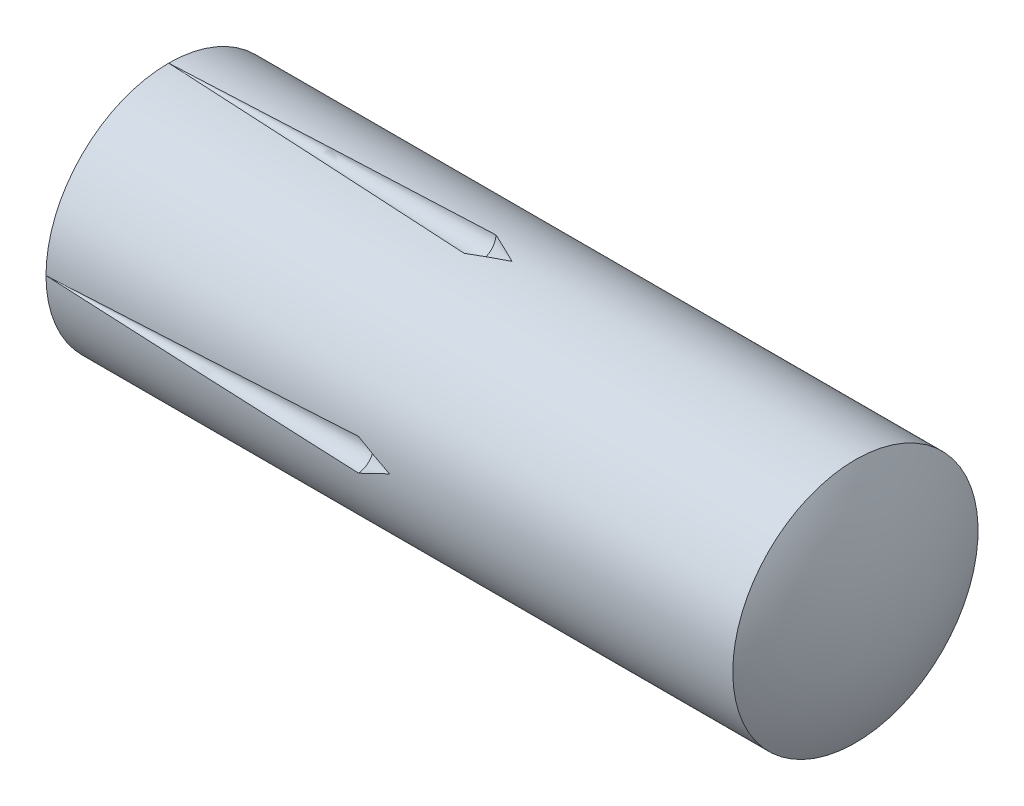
ISO-10303-21;
HEADER;
FILE_DESCRIPTION(('STEP AP214'),'2;1');
FILE_NAME('part.step','',(''),(''),'','','');
FILE_SCHEMA(('AUTOMOTIVE_DESIGN { 1 0 10303 214 1 1 1 1 }'));
ENDSEC;
DATA;
#1=APPLICATION_CONTEXT('core data for automotive mechanical design processes');
#2=APPLICATION_PROTOCOL_DEFINITION('international standard','automotive_design',2000,#1);
#3=PRODUCT_CONTEXT('',#1,'mechanical');
#4=PRODUCT('Part','Part','',(#3));
#5=PRODUCT_RELATED_PRODUCT_CATEGORY('part','',(#4));
#6=PRODUCT_DEFINITION_FORMATION('','',#4);
#7=PRODUCT_DEFINITION_CONTEXT('part definition',#1,'design');
#8=PRODUCT_DEFINITION('design','',#6,#7);
#9=PRODUCT_DEFINITION_SHAPE('','',#8);
#10=(LENGTH_UNIT() NAMED_UNIT(*) SI_UNIT(.MILLI.,.METRE.));
#11=(NAMED_UNIT(*) PLANE_ANGLE_UNIT() SI_UNIT($,.RADIAN.));
#12=(NAMED_UNIT(*) SI_UNIT($,.STERADIAN.) SOLID_ANGLE_UNIT());
#13=UNCERTAINTY_MEASURE_WITH_UNIT(LENGTH_MEASURE(1.E-05),#10,'distance_accuracy_value','');
#14=(GEOMETRIC_REPRESENTATION_CONTEXT(3) GLOBAL_UNCERTAINTY_ASSIGNED_CONTEXT((#13)) GLOBAL_UNIT_ASSIGNED_CONTEXT((#10,
#11,#12)) REPRESENTATION_CONTEXT('',''));
#15=CARTESIAN_POINT('',(0.,0.,0.));
#16=DIRECTION('',(0.,0.,1.));
#17=DIRECTION('',(1.,0.,0.));
#18=AXIS2_PLACEMENT_3D('',#15,#16,#17);
#19=CARTESIAN_POINT('',(0.,0.,0.));
#20=DIRECTION('',(-1.,0.,0.));
#21=DIRECTION('',(0.,0.,1.));
#22=AXIS2_PLACEMENT_3D('',#19,#20,#21);
#23=CYLINDRICAL_SURFACE('',#22,5.);
#24=CARTESIAN_POINT('',(29.3,0.,0.));
#25=DIRECTION('',(-1.,0.,0.));
#26=DIRECTION('',(0.,0.,1.));
#27=AXIS2_PLACEMENT_3D('',#24,#25,#26);
#28=CIRCLE('',#27,5.);
#29=CARTESIAN_POINT('',(29.3,0.,5.));
#30=VERTEX_POINT('',#29);
#31=EDGE_CURVE('E538',#30,#30,#28,.T.);
#32=ORIENTED_EDGE('',*,*,#31,.T.);
#33=EDGE_LOOP('',(#32));
#34=FACE_BOUND('',#33,.T.);
#35=CARTESIAN_POINT('',(1.3,0.,0.));
#36=DIRECTION('',(-1.,0.,0.));
#37=DIRECTION('',(0.,0.,1.));
#38=AXIS2_PLACEMENT_3D('',#35,#36,#37);
#39=CIRCLE('',#38,5.);
#40=CARTESIAN_POINT('',(1.3,0.,5.));
#41=VERTEX_POINT('',#40);
#42=CARTESIAN_POINT('',(1.3,5.,0.));
#43=VERTEX_POINT('',#42);
#44=EDGE_CURVE('E531',#41,#43,#39,.T.);
#45=ORIENTED_EDGE('',*,*,#44,.F.);
#46=CARTESIAN_POINT('',(1.3,0.,5.));
#47=CARTESIAN_POINT('',(1.30006543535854,3.34905383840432E-06,5.00000000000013));
#48=CARTESIAN_POINT('',(1.30013087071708,6.69810762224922E-06,4.99999999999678));
#49=CARTESIAN_POINT('',(1.30026094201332,1.33552999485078E-05,4.99999999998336));
#50=CARTESIAN_POINT('',(1.30032557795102,1.66634384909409E-05,4.99999999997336));
#51=CARTESIAN_POINT('',(1.30052028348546,2.66286823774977E-05,4.99999999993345));
#52=CARTESIAN_POINT('',(1.3006503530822,3.32857877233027E-05,4.99999999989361));
#53=CARTESIAN_POINT('',(1.30104056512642,5.32572703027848E-05,4.99999999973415));
#54=CARTESIAN_POINT('',(1.30130070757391,6.65716475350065E-05,4.99999999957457));
#55=CARTESIAN_POINT('',(1.30208114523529,0.00010651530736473,4.99999999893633));
#56=CARTESIAN_POINT('',(1.30260144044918,0.000133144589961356,4.99999999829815));
#57=CARTESIAN_POINT('',(1.30416236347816,0.000213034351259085,4.99999999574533));
#58=CARTESIAN_POINT('',(1.30520299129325,0.000266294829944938,4.99999999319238));
#59=CARTESIAN_POINT('',(1.30832502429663,0.000426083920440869,4.99999998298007));
#60=CARTESIAN_POINT('',(1.31040642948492,0.000532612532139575,4.99999997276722));
#61=CARTESIAN_POINT('',(1.31665124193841,0.000852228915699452,4.99999993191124));
#62=CARTESIAN_POINT('',(1.32081464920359,0.00106531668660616,4.99999989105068));
#63=CARTESIAN_POINT('',(1.33330725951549,0.00170470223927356,4.99999972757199));
#64=CARTESIAN_POINT('',(1.34163646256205,0.00213100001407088,4.99999956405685));
#65=CARTESIAN_POINT('',(1.36663363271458,0.00341038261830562,4.99999890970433));
#66=CARTESIAN_POINT('',(1.38330159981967,0.00426346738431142,4.99999825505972));
#67=CARTESIAN_POINT('',(1.43334380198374,0.00682468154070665,4.9999956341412));
#68=CARTESIAN_POINT('',(1.46671803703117,0.00853281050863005,4.99999301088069));
#69=CARTESIAN_POINT('',(1.56699440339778,0.0136650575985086,4.99998249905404));
#70=CARTESIAN_POINT('',(1.63389653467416,0.0170891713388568,4.99997196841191));
#71=CARTESIAN_POINT('',(1.83522124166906,0.027393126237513,4.99992969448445));
#72=CARTESIAN_POINT('',(1.96964381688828,0.034272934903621,4.99988726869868));
#73=CARTESIAN_POINT('',(2.37541462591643,0.0550402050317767,4.99971633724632));
#74=CARTESIAN_POINT('',(2.64676285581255,0.0689273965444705,4.99954416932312));
#75=CARTESIAN_POINT('',(3.47106496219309,0.111111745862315,4.9988453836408));
#76=CARTESIAN_POINT('',(4.02401880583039,0.139406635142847,4.99813634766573));
#77=CARTESIAN_POINT('',(5.72598095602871,0.226478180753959,4.99521440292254));
#78=CARTESIAN_POINT('',(6.87498897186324,0.28523477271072,4.99220427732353));
#79=CARTESIAN_POINT('',(10.5129699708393,0.471099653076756,4.97938873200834));
#80=CARTESIAN_POINT('',(13.0019401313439,0.598009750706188,4.96575247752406));
#81=CARTESIAN_POINT('',(15.4909027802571,0.724387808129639,4.94724795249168));
#82=B_SPLINE_CURVE_WITH_KNOTS('',3,(#46,#47,#48,#49,#50,#51,#52,#53,#54,#55,#56,#57,#58,#59,#60,
#61,#62,#63,#64,#65,#66,#67,#68,#69,#70,#71,#72,#73,#74,#75,#76,#77,#78,#79,#80,#81),
.UNSPECIFIED.,.F.,.F.,(4,2,2,2,2,2,2,2,2,2,2,2,2,2,2,2,2,4),(0.,0.000196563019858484,
0.000390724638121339,0.000781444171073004,0.00156289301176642,0.00312582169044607,
0.00625179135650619,0.0125041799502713,0.025010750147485,0.0500310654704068,0.100100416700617,
0.200354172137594,0.401323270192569,0.805118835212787,1.6202290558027,3.28126212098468,
6.73280018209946,14.209504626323),.UNSPECIFIED.);
#83=CARTESIAN_POINT('',(14.,0.648625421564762,4.95774999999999));
#84=VERTEX_POINT('',#83);
#85=EDGE_CURVE('E11',#41,#84,#82,.T.);
#86=ORIENTED_EDGE('',*,*,#85,.T.);
#87=CARTESIAN_POINT('',(15.3,0.,5.));
#88=CARTESIAN_POINT('',(15.2999927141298,3.642935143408E-06,5.00000000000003));
#89=CARTESIAN_POINT('',(15.2999854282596,7.28587023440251E-06,4.99999999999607));
#90=CARTESIAN_POINT('',(15.2999185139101,4.0743045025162E-05,4.99999999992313));
#91=CARTESIAN_POINT('',(15.2998588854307,7.05572847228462E-05,4.99999999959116));
#92=CARTESIAN_POINT('',(15.2995607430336,0.00021962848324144,4.99999999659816));
#93=CARTESIAN_POINT('',(15.2993222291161,0.000338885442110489,4.99999998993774));
#94=CARTESIAN_POINT('',(15.298129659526,0.000935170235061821,4.99999993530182));
#95=CARTESIAN_POINT('',(15.297175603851,0.00141219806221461,4.99999982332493));
#96=CARTESIAN_POINT('',(15.2924053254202,0.00379733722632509,4.99999892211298));
#97=CARTESIAN_POINT('',(15.288589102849,0.00570544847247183,4.99999710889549));
#98=CARTESIAN_POINT('',(15.269507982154,0.0152460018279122,4.99998258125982));
#99=CARTESIAN_POINT('',(15.2542430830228,0.0228784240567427,4.9999534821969));
#100=CARTESIAN_POINT('',(15.1779181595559,0.0610403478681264,4.99972061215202));
#101=CARTESIAN_POINT('',(15.1168582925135,0.0915685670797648,4.99925471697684));
#102=CARTESIAN_POINT('',(14.811529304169,0.244198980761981,4.99552646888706));
#103=CARTESIAN_POINT('',(14.5672635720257,0.366222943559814,4.98806779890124));
#104=CARTESIAN_POINT('',(13.7412905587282,0.77772857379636,4.94772324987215));
#105=CARTESIAN_POINT('',(13.159729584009,1.06559963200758,4.8939430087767));
#106=CARTESIAN_POINT('',(12.5787204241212,1.34798590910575,4.8148659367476));
#107=B_SPLINE_CURVE_WITH_KNOTS('',3,(#87,#88,#89,#90,#91,#92,#93,#94,#95,#96,#97,#98,#99,#100,
#101,#102,#103,#104,#105,#106),.UNSPECIFIED.,.F.,.F.,(4,2,2,2,2,2,2,2,2,4),(0.,
2.44375515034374E-05,0.000224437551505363,0.00102443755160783,0.00422443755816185,
0.0170244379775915,0.0682244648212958,0.273026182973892,1.09233630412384,3.043839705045),.UNSPECIFIED.);
#108=CARTESIAN_POINT('',(15.3,0.,5.));
#109=VERTEX_POINT('',#108);
#110=EDGE_CURVE('E633',#84,#109,#107,.F.);
#111=ORIENTED_EDGE('',*,*,#110,.T.);
#112=CARTESIAN_POINT('',(15.3,0.,5.));
#113=CARTESIAN_POINT('',(15.2999927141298,-3.6429350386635E-06,5.00000000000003));
#114=CARTESIAN_POINT('',(15.2999854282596,-7.28587012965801E-06,4.99999999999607));
#115=CARTESIAN_POINT('',(15.2999185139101,-4.07430449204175E-05,4.99999999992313));
#116=CARTESIAN_POINT('',(15.2998588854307,-7.05572846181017E-05,4.99999999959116));
#117=CARTESIAN_POINT('',(15.2995607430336,-0.000219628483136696,4.99999999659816));
#118=CARTESIAN_POINT('',(15.2993222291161,-0.000338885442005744,4.99999998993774));
#119=CARTESIAN_POINT('',(15.298129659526,-0.000935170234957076,4.99999993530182));
#120=CARTESIAN_POINT('',(15.297175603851,-0.00141219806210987,4.99999982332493));
#121=CARTESIAN_POINT('',(15.2924053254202,-0.00379733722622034,4.99999892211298));
#122=CARTESIAN_POINT('',(15.288589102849,-0.00570544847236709,4.99999710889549));
#123=CARTESIAN_POINT('',(15.269507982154,-0.0152460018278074,4.99998258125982));
#124=CARTESIAN_POINT('',(15.2542430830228,-0.0228784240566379,4.9999534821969));
#125=CARTESIAN_POINT('',(15.1779181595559,-0.0610403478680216,4.99972061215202));
#126=CARTESIAN_POINT('',(15.1168582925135,-0.09156856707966,4.99925471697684));
#127=CARTESIAN_POINT('',(14.811529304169,-0.244198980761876,4.99552646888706));
#128=CARTESIAN_POINT('',(14.5672635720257,-0.366222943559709,4.98806779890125));
#129=CARTESIAN_POINT('',(13.7412905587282,-0.777728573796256,4.94772324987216));
#130=CARTESIAN_POINT('',(13.159729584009,-1.06559963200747,4.89394300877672));
#131=CARTESIAN_POINT('',(12.5787204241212,-1.34798590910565,4.81486593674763));
#132=B_SPLINE_CURVE_WITH_KNOTS('',3,(#112,#113,#114,#115,#116,#117,#118,#119,#120,#121,#122,
#123,#124,#125,#126,#127,#128,#129,#130,#131),.UNSPECIFIED.,.F.,.F.,(4,2,2,2,2,2,2,2,2,4),(0.,
2.44375515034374E-05,0.000224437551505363,0.00102443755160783,0.00422443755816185,
0.0170244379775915,0.0682244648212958,0.273026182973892,1.09233630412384,3.043839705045),.UNSPECIFIED.);
#133=CARTESIAN_POINT('',(14.,-0.648625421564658,4.95775000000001));
#134=VERTEX_POINT('',#133);
#135=EDGE_CURVE('E469',#109,#134,#132,.T.);
#136=ORIENTED_EDGE('',*,*,#135,.T.);
#137=CARTESIAN_POINT('',(1.3,0.,5.));
#138=CARTESIAN_POINT('',(1.30006543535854,-3.34905373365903E-06,5.00000000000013));
#139=CARTESIAN_POINT('',(1.30013087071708,-6.69810751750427E-06,4.99999999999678));
#140=CARTESIAN_POINT('',(1.3002609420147,-1.33552999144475E-05,4.99999999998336));
#141=CARTESIAN_POINT('',(1.30032557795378,-1.6663438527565E-05,4.99999999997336));
#142=CARTESIAN_POINT('',(1.30052028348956,-2.6628682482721E-05,4.99999999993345));
#143=CARTESIAN_POINT('',(1.30065035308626,-3.32857878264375E-05,4.99999999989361));
#144=CARTESIAN_POINT('',(1.30104056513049,-5.32572704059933E-05,4.99999999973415));
#145=CARTESIAN_POINT('',(1.30130070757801,-6.65716476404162E-05,4.99999999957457));
#146=CARTESIAN_POINT('',(1.30208114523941,-0.000106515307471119,4.99999999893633));
#147=CARTESIAN_POINT('',(1.30260144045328,-0.000133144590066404,4.99999999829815));
#148=CARTESIAN_POINT('',(1.30416236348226,-0.00021303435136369,4.99999999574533));
#149=CARTESIAN_POINT('',(1.30520299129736,-0.000266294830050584,4.99999999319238));
#150=CARTESIAN_POINT('',(1.30832502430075,-0.000426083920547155,4.99999998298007));
#151=CARTESIAN_POINT('',(1.31040642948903,-0.000532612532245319,4.99999997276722));
#152=CARTESIAN_POINT('',(1.31665124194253,-0.000852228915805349,4.99999993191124));
#153=CARTESIAN_POINT('',(1.32081464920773,-0.00106531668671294,4.99999989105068));
#154=CARTESIAN_POINT('',(1.33330725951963,-0.00170470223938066,4.99999972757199));
#155=CARTESIAN_POINT('',(1.34163646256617,-0.00213100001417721,4.99999956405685));
#156=CARTESIAN_POINT('',(1.36663363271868,-0.00341038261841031,4.99999890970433));
#157=CARTESIAN_POINT('',(1.38330159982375,-0.00426346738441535,4.99999825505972));
#158=CARTESIAN_POINT('',(1.43334380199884,-0.00682468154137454,4.9999956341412));
#159=CARTESIAN_POINT('',(1.4667180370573,-0.00853281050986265,4.99999301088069));
#160=CARTESIAN_POINT('',(1.56699440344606,-0.0136650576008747,4.99998249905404));
#161=CARTESIAN_POINT('',(1.63389653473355,-0.0170891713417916,4.9999719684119));
#162=CARTESIAN_POINT('',(1.83522124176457,-0.0273931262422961,4.99992969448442));
#163=CARTESIAN_POINT('',(1.96964381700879,-0.0342729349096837,4.99988726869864));
#164=CARTESIAN_POINT('',(2.37541462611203,-0.0550402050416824,4.99971633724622));
#165=CARTESIAN_POINT('',(2.64676285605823,-0.0689273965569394,4.99954416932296));
#166=CARTESIAN_POINT('',(3.47106496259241,-0.111111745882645,4.99884538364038));
#167=CARTESIAN_POINT('',(4.02401880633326,-0.139406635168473,4.99813634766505));
#168=CARTESIAN_POINT('',(5.72598095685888,-0.226478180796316,4.99521440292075));
#169=CARTESIAN_POINT('',(6.87498897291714,-0.2852347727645,4.99220427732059));
#170=CARTESIAN_POINT('',(10.5129699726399,-0.47109965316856,4.97938873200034));
#171=CARTESIAN_POINT('',(13.0019401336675,-0.598009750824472,4.9657524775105));
#172=CARTESIAN_POINT('',(15.4909027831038,-0.724387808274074,4.94724795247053));
#173=B_SPLINE_CURVE_WITH_KNOTS('',3,(#137,#138,#139,#140,#141,#142,#143,#144,#145,#146,#147,
#148,#149,#150,#151,#152,#153,#154,#155,#156,#157,#158,#159,#160,#161,#162,#163,#164,#165,#166,
#167,#168,#169,#170,#171,#172),.UNSPECIFIED.,.F.,.F.,(4,2,2,2,2,2,2,2,2,2,2,2,2,2,2,2,2,4),(0.,
0.000196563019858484,0.000390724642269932,0.000781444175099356,0.00156289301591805,
0.00312582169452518,0.00625179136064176,0.0125041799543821,0.0250107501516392,
0.0500310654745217,0.100100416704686,0.200354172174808,0.401323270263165,0.80511883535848,
1.62022905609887,3.2812621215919,6.73280018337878,14.2095046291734),.UNSPECIFIED.);
#174=EDGE_CURVE('E462',#134,#41,#173,.F.);
#175=ORIENTED_EDGE('',*,*,#174,.T.);
#176=CARTESIAN_POINT('',(1.3,-5.,0.));
#177=VERTEX_POINT('',#176);
#178=EDGE_CURVE('E528',#177,#41,#39,.T.);
#179=ORIENTED_EDGE('',*,*,#178,.F.);
#180=CARTESIAN_POINT('',(1.3,-5.,0.));
#181=CARTESIAN_POINT('',(1.30006543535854,-5.00000000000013,3.34905382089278E-06));
#182=CARTESIAN_POINT('',(1.30013087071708,-4.99999999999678,6.69810760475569E-06));
#183=CARTESIAN_POINT('',(1.30026094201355,-4.99999999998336,1.33552999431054E-05));
#184=CARTESIAN_POINT('',(1.30032557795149,-4.99999999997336,1.66634384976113E-05));
#185=CARTESIAN_POINT('',(1.30052028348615,-4.99999999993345,2.66286823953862E-05));
#186=CARTESIAN_POINT('',(1.30065035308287,-4.99999999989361,3.32857877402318E-05));
#187=CARTESIAN_POINT('',(1.30104056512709,-4.99999999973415,5.32572703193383E-05));
#188=CARTESIAN_POINT('',(1.30130070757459,-4.99999999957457,6.65716475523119E-05));
#189=CARTESIAN_POINT('',(1.30208114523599,-4.99999999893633,0.000106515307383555));
#190=CARTESIAN_POINT('',(1.3026014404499,-4.99999999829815,0.000133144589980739));
#191=CARTESIAN_POINT('',(1.30416236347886,-4.99999999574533,0.000213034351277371));
#192=CARTESIAN_POINT('',(1.30520299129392,-4.99999999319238,0.000266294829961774));
#193=CARTESIAN_POINT('',(1.30832502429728,-4.99999998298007,0.000426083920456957));
#194=CARTESIAN_POINT('',(1.31040642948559,-4.99999997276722,0.000532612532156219));
#195=CARTESIAN_POINT('',(1.3166512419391,-4.99999993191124,0.000852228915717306));
#196=CARTESIAN_POINT('',(1.3208146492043,-4.99999989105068,0.00106531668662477));
#197=CARTESIAN_POINT('',(1.33330725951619,-4.99999972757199,0.00170470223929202));
#198=CARTESIAN_POINT('',(1.34163646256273,-4.99999956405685,0.00213100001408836));
#199=CARTESIAN_POINT('',(1.36663363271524,-4.99999890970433,0.0034103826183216));
#200=CARTESIAN_POINT('',(1.38330159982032,-4.99999825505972,0.00426346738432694));
#201=CARTESIAN_POINT('',(1.43334380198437,-4.9999956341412,0.00682468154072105));
#202=CARTESIAN_POINT('',(1.46671803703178,-4.99999301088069,0.00853281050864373));
#203=CARTESIAN_POINT('',(1.56699440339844,-4.99998249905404,0.0136650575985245));
#204=CARTESIAN_POINT('',(1.63389653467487,-4.99997196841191,0.0170891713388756));
#205=CARTESIAN_POINT('',(1.83522124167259,-4.99992969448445,0.0273931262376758));
#206=CARTESIAN_POINT('',(1.96964381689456,-4.99988726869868,0.034272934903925));
#207=CARTESIAN_POINT('',(2.3754146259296,-4.99971633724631,0.0550402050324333));
#208=CARTESIAN_POINT('',(2.64676285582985,-4.99954416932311,0.0689273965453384));
#209=CARTESIAN_POINT('',(3.47106496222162,-4.99884538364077,0.111111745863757));
#210=CARTESIAN_POINT('',(4.02401880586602,-4.99813634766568,0.139406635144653));
#211=CARTESIAN_POINT('',(5.72598095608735,-4.99521440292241,0.226478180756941));
#212=CARTESIAN_POINT('',(6.87498897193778,-4.99220427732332,0.285234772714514));
#213=CARTESIAN_POINT('',(10.5129699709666,-4.97938873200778,0.471099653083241));
#214=CARTESIAN_POINT('',(13.0019401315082,-4.96575247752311,0.598009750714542));
#215=CARTESIAN_POINT('',(15.4909027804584,-4.94724795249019,0.724387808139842));
#216=B_SPLINE_CURVE_WITH_KNOTS('',3,(#180,#181,#182,#183,#184,#185,#186,#187,#188,#189,#190,
#191,#192,#193,#194,#195,#196,#197,#198,#199,#200,#201,#202,#203,#204,#205,#206,#207,#208,#209,
#210,#211,#212,#213,#214,#215),.UNSPECIFIED.,.F.,.F.,(4,2,2,2,2,2,2,2,2,2,2,2,2,2,2,2,2,4),(0.,
0.000196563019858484,0.000390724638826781,0.000781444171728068,0.00156289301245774,
0.00312582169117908,0.0062517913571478,0.0125041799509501,0.025010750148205,0.0500310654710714,
0.100100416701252,0.200354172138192,0.40132327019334,0.80511883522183,1.62022905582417,
3.28126212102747,6.73280018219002,14.2095046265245),.UNSPECIFIED.);
#217=CARTESIAN_POINT('',(14.,-4.95775,0.648625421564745));
#218=VERTEX_POINT('',#217);
#219=EDGE_CURVE('E627',#177,#218,#216,.T.);
#220=ORIENTED_EDGE('',*,*,#219,.T.);
#221=CARTESIAN_POINT('',(15.3,-5.,0.));
#222=CARTESIAN_POINT('',(15.2999927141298,-5.00000000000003,3.64293512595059E-06));
#223=CARTESIAN_POINT('',(15.2999854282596,-4.99999999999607,7.28587021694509E-06));
#224=CARTESIAN_POINT('',(15.2999185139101,-4.99999999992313,4.07430450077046E-05));
#225=CARTESIAN_POINT('',(15.2998588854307,-4.99999999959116,7.05572847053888E-05));
#226=CARTESIAN_POINT('',(15.2995607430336,-4.99999999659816,0.000219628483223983));
#227=CARTESIAN_POINT('',(15.2993222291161,-4.99999998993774,0.000338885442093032));
#228=CARTESIAN_POINT('',(15.298129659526,-4.99999993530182,0.000935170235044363));
#229=CARTESIAN_POINT('',(15.297175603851,-4.99999982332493,0.00141219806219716));
#230=CARTESIAN_POINT('',(15.2924053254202,-4.99999892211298,0.00379733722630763));
#231=CARTESIAN_POINT('',(15.288589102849,-4.99999710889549,0.00570544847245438));
#232=CARTESIAN_POINT('',(15.269507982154,-4.99998258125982,0.0152460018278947));
#233=CARTESIAN_POINT('',(15.2542430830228,-4.9999534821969,0.0228784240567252));
#234=CARTESIAN_POINT('',(15.1779181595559,-4.99972061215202,0.0610403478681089));
#235=CARTESIAN_POINT('',(15.1168582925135,-4.99925471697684,0.0915685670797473));
#236=CARTESIAN_POINT('',(14.811529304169,-4.99552646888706,0.244198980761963));
#237=CARTESIAN_POINT('',(14.5672635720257,-4.98806779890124,0.366222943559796));
#238=CARTESIAN_POINT('',(13.7412905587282,-4.94772324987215,0.777728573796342));
#239=CARTESIAN_POINT('',(13.159729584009,-4.8939430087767,1.06559963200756));
#240=CARTESIAN_POINT('',(12.5787204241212,-4.81486593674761,1.34798590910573));
#241=B_SPLINE_CURVE_WITH_KNOTS('',3,(#221,#222,#223,#224,#225,#226,#227,#228,#229,#230,#231,
#232,#233,#234,#235,#236,#237,#238,#239,#240),.UNSPECIFIED.,.F.,.F.,(4,2,2,2,2,2,2,2,2,4),(0.,
2.44375515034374E-05,0.000224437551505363,0.00102443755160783,0.00422443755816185,
0.0170244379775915,0.0682244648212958,0.273026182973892,1.09233630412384,3.043839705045),.UNSPECIFIED.);
#242=CARTESIAN_POINT('',(15.3,-5.,0.));
#243=VERTEX_POINT('',#242);
#244=EDGE_CURVE('E608',#218,#243,#241,.F.);
#245=ORIENTED_EDGE('',*,*,#244,.T.);
#246=CARTESIAN_POINT('',(15.3,-5.,0.));
#247=CARTESIAN_POINT('',(15.2999927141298,-5.00000000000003,-3.64293505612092E-06));
#248=CARTESIAN_POINT('',(15.2999854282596,-4.99999999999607,-7.28587014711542E-06));
#249=CARTESIAN_POINT('',(15.2999185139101,-4.99999999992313,-4.0743044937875E-05));
#250=CARTESIAN_POINT('',(15.2998588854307,-4.99999999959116,-7.05572846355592E-05));
#251=CARTESIAN_POINT('',(15.2995607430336,-4.99999999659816,-0.000219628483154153));
#252=CARTESIAN_POINT('',(15.2993222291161,-4.99999998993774,-0.000338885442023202));
#253=CARTESIAN_POINT('',(15.298129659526,-4.99999993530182,-0.000935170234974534));
#254=CARTESIAN_POINT('',(15.297175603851,-4.99999982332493,-0.00141219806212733));
#255=CARTESIAN_POINT('',(15.2924053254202,-4.99999892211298,-0.0037973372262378));
#256=CARTESIAN_POINT('',(15.288589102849,-4.99999710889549,-0.00570544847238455));
#257=CARTESIAN_POINT('',(15.269507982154,-4.99998258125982,-0.0152460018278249));
#258=CARTESIAN_POINT('',(15.2542430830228,-4.9999534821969,-0.0228784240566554));
#259=CARTESIAN_POINT('',(15.1779181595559,-4.99972061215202,-0.0610403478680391));
#260=CARTESIAN_POINT('',(15.1168582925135,-4.99925471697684,-0.0915685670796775));
#261=CARTESIAN_POINT('',(14.811529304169,-4.99552646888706,-0.244198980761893));
#262=CARTESIAN_POINT('',(14.5672635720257,-4.98806779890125,-0.366222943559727));
#263=CARTESIAN_POINT('',(13.7412905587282,-4.94772324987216,-0.777728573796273));
#264=CARTESIAN_POINT('',(13.159729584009,-4.89394300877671,-1.06559963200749));
#265=CARTESIAN_POINT('',(12.5787204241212,-4.81486593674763,-1.34798590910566));
#266=B_SPLINE_CURVE_WITH_KNOTS('',3,(#246,#247,#248,#249,#250,#251,#252,#253,#254,#255,#256,
#257,#258,#259,#260,#261,#262,#263,#264,#265),.UNSPECIFIED.,.F.,.F.,(4,2,2,2,2,2,2,2,2,4),(0.,
2.44375515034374E-05,0.000224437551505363,0.00102443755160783,0.00422443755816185,
0.0170244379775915,0.0682244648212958,0.273026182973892,1.09233630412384,3.043839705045),.UNSPECIFIED.);
#267=CARTESIAN_POINT('',(14.,-4.95775000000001,-0.648625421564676));
#268=VERTEX_POINT('',#267);
#269=EDGE_CURVE('E477',#243,#268,#266,.T.);
#270=ORIENTED_EDGE('',*,*,#269,.T.);
#271=CARTESIAN_POINT('',(1.3,-5.,0.));
#272=CARTESIAN_POINT('',(1.30006543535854,-5.00000000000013,-3.34905375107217E-06));
#273=CARTESIAN_POINT('',(1.30013087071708,-4.99999999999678,-6.69810753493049E-06));
#274=CARTESIAN_POINT('',(1.30026094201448,-4.99999999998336,-1.33552999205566E-05));
#275=CARTESIAN_POINT('',(1.30032557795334,-4.99999999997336,-1.66634385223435E-05));
#276=CARTESIAN_POINT('',(1.30052028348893,-4.99999999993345,-2.66286824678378E-05));
#277=CARTESIAN_POINT('',(1.30065035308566,-4.99999999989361,-3.32857878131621E-05));
#278=CARTESIAN_POINT('',(1.30104056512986,-4.99999999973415,-5.32572703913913E-05));
#279=CARTESIAN_POINT('',(1.30130070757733,-4.99999999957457,-6.65716476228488E-05));
#280=CARTESIAN_POINT('',(1.30208114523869,-4.99999999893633,-0.000106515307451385));
#281=CARTESIAN_POINT('',(1.30260144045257,-4.99999999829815,-0.00013314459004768));
#282=CARTESIAN_POINT('',(1.30416236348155,-4.99999999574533,-0.000213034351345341));
#283=CARTESIAN_POINT('',(1.30520299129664,-4.99999999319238,-0.000266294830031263));
#284=CARTESIAN_POINT('',(1.30832502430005,-4.99999998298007,-0.000426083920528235));
#285=CARTESIAN_POINT('',(1.31040642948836,-4.99999997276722,-0.000532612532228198));
#286=CARTESIAN_POINT('',(1.31665124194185,-4.99999993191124,-0.000852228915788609));
#287=CARTESIAN_POINT('',(1.32081464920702,-4.99999989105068,-0.00106531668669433));
#288=CARTESIAN_POINT('',(1.33330725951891,-4.99999972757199,-0.00170470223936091));
#289=CARTESIAN_POINT('',(1.34163646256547,-4.99999956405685,-0.00213100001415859));
#290=CARTESIAN_POINT('',(1.36663363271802,-4.99999890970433,-0.00341038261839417));
#291=CARTESIAN_POINT('',(1.38330159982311,-4.99999825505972,-0.00426346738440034));
#292=CARTESIAN_POINT('',(1.4333438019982,-4.9999956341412,-0.00682468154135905));
#293=CARTESIAN_POINT('',(1.46671803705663,-4.99999301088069,-0.00853281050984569));
#294=CARTESIAN_POINT('',(1.56699440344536,-4.99998249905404,-0.0136650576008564));
#295=CARTESIAN_POINT('',(1.63389653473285,-4.9999719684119,-0.0170891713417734));
#296=CARTESIAN_POINT('',(1.83522124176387,-4.99992969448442,-0.0273931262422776));
#297=CARTESIAN_POINT('',(1.96964381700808,-4.99988726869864,-0.0342729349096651));
#298=CARTESIAN_POINT('',(2.37541462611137,-4.99971633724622,-0.0550402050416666));
#299=CARTESIAN_POINT('',(2.64676285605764,-4.99954416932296,-0.0689273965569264));
#300=CARTESIAN_POINT('',(3.47106496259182,-4.99884538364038,-0.111111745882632));
#301=CARTESIAN_POINT('',(4.02401880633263,-4.99813634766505,-0.139406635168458));
#302=CARTESIAN_POINT('',(5.72598095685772,-4.99521440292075,-0.226478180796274));
#303=CARTESIAN_POINT('',(6.87498897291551,-4.99220427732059,-0.285234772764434));
#304=CARTESIAN_POINT('',(10.5129699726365,-4.97938873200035,-0.471099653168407));
#305=CARTESIAN_POINT('',(13.0019401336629,-4.96575247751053,-0.598009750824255));
#306=CARTESIAN_POINT('',(15.4909027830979,-4.94724795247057,-0.724387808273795));
#307=B_SPLINE_CURVE_WITH_KNOTS('',3,(#271,#272,#273,#274,#275,#276,#277,#278,#279,#280,#281,
#282,#283,#284,#285,#286,#287,#288,#289,#290,#291,#292,#293,#294,#295,#296,#297,#298,#299,#300,
#301,#302,#303,#304,#305,#306),.UNSPECIFIED.,.F.,.F.,(4,2,2,2,2,2,2,2,2,2,2,2,2,2,2,2,2,4),(0.,
0.000196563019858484,0.000390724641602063,0.00078144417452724,0.00156289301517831,
0.00312582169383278,0.00625179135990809,0.0125041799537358,0.0250107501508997,
0.0500310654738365,0.100100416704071,0.200354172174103,0.40132327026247,0.805118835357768,
1.62022905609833,3.28126212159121,6.73280018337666,14.2095046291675),.UNSPECIFIED.);
#308=EDGE_CURVE('E620',#268,#177,#307,.F.);
#309=ORIENTED_EDGE('',*,*,#308,.T.);
#310=CARTESIAN_POINT('',(1.3,0.,-5.));
#311=VERTEX_POINT('',#310);
#312=EDGE_CURVE('E542',#311,#177,#39,.T.);
#313=ORIENTED_EDGE('',*,*,#312,.F.);
#314=CARTESIAN_POINT('',(1.3,0.,-5.));
#315=CARTESIAN_POINT('',(1.30006543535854,-3.34905380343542E-06,-5.00000000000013));
#316=CARTESIAN_POINT('',(1.30013087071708,-6.69810758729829E-06,-4.99999999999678));
#317=CARTESIAN_POINT('',(1.30026094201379,-1.33552999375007E-05,-4.99999999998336));
#318=CARTESIAN_POINT('',(1.30032557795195,-1.66634385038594E-05,-4.99999999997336));
#319=CARTESIAN_POINT('',(1.30052028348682,-2.66286824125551E-05,-4.99999999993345));
#320=CARTESIAN_POINT('',(1.30065035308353,-3.32857877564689E-05,-4.99999999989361));
#321=CARTESIAN_POINT('',(1.30104056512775,-5.32572703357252E-05,-4.99999999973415));
#322=CARTESIAN_POINT('',(1.30130070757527,-6.65716475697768E-05,-4.99999999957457));
#323=CARTESIAN_POINT('',(1.30208114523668,-0.000106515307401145,-4.99999999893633));
#324=CARTESIAN_POINT('',(1.30260144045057,-0.000133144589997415,-4.99999999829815));
#325=CARTESIAN_POINT('',(1.30416236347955,-0.000213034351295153,-4.99999999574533));
#326=CARTESIAN_POINT('',(1.30520299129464,-0.000266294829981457,-4.99999999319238));
#327=CARTESIAN_POINT('',(1.30832502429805,-0.000426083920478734,-4.99999998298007));
#328=CARTESIAN_POINT('',(1.31040642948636,-0.000532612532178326,-4.99999997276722));
#329=CARTESIAN_POINT('',(1.31665124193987,-0.00085222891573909,-4.99999993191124));
#330=CARTESIAN_POINT('',(1.32081464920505,-0.00106531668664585,-4.99999989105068));
#331=CARTESIAN_POINT('',(1.33330725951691,-0.00170470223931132,-4.99999972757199));
#332=CARTESIAN_POINT('',(1.34163646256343,-0.00213100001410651,-4.99999956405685));
#333=CARTESIAN_POINT('',(1.36663363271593,-0.00341038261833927,-4.99999890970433));
#334=CARTESIAN_POINT('',(1.38330159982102,-0.0042634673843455,-4.99999825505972));
#335=CARTESIAN_POINT('',(1.43334380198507,-0.00682468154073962,-4.9999956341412));
#336=CARTESIAN_POINT('',(1.46671803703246,-0.00853281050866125,-4.99999301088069));
#337=CARTESIAN_POINT('',(1.56699440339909,-0.0136650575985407,-4.99998249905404));
#338=CARTESIAN_POINT('',(1.63389653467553,-0.0170891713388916,-4.99997196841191));
#339=CARTESIAN_POINT('',(1.83522124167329,-0.0273931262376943,-4.99992969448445));
#340=CARTESIAN_POINT('',(1.96964381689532,-0.0342729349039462,-4.99988726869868));
#341=CARTESIAN_POINT('',(2.37541462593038,-0.0550402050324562,-4.99971633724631));
#342=CARTESIAN_POINT('',(2.64676285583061,-0.0689273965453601,-4.99954416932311));
#343=CARTESIAN_POINT('',(3.47106496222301,-0.111111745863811,-4.99884538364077));
#344=CARTESIAN_POINT('',(4.02401880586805,-0.139406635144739,-4.99813634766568));
#345=CARTESIAN_POINT('',(5.72598095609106,-0.226478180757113,-4.9952144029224));
#346=CARTESIAN_POINT('',(6.87498897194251,-0.285234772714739,-4.99220427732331));
#347=CARTESIAN_POINT('',(10.5129699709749,-0.471099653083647,-4.97938873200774));
#348=CARTESIAN_POINT('',(13.0019401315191,-0.598009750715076,-4.96575247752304));
#349=CARTESIAN_POINT('',(15.4909027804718,-0.724387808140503,-4.94724795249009));
#350=B_SPLINE_CURVE_WITH_KNOTS('',3,(#314,#315,#316,#317,#318,#319,#320,#321,#322,#323,#324,
#325,#326,#327,#328,#329,#330,#331,#332,#333,#334,#335,#336,#337,#338,#339,#340,#341,#342,#343,
#344,#345,#346,#347,#348,#349),.UNSPECIFIED.,.F.,.F.,(4,2,2,2,2,2,2,2,2,2,2,2,2,2,2,2,2,4),(0.,
0.000196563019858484,0.000390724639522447,0.000781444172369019,0.00156289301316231,
0.00312582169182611,0.00625179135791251,0.0125041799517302,0.0250107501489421,
0.0500310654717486,0.100100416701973,0.200354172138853,0.401323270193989,0.805118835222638,
1.62022905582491,3.28126212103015,6.73280018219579,14.2095046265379),.UNSPECIFIED.);
#351=CARTESIAN_POINT('',(14.,-0.648625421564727,-4.95775));
#352=VERTEX_POINT('',#351);
#353=EDGE_CURVE('E602',#311,#352,#350,.T.);
#354=ORIENTED_EDGE('',*,*,#353,.T.);
#355=CARTESIAN_POINT('',(15.3,0.,-5.));
#356=CARTESIAN_POINT('',(15.2999927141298,-3.64293510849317E-06,-5.00000000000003));
#357=CARTESIAN_POINT('',(15.2999854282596,-7.28587019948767E-06,-4.99999999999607));
#358=CARTESIAN_POINT('',(15.2999185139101,-4.07430449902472E-05,-4.99999999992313));
#359=CARTESIAN_POINT('',(15.2998588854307,-7.05572846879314E-05,-4.99999999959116));
#360=CARTESIAN_POINT('',(15.2995607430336,-0.000219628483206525,-4.99999999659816));
#361=CARTESIAN_POINT('',(15.2993222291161,-0.000338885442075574,-4.99999998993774));
#362=CARTESIAN_POINT('',(15.298129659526,-0.000935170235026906,-4.99999993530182));
#363=CARTESIAN_POINT('',(15.297175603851,-0.0014121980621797,-4.99999982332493));
#364=CARTESIAN_POINT('',(15.2924053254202,-0.00379733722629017,-4.99999892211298));
#365=CARTESIAN_POINT('',(15.288589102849,-0.00570544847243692,-4.99999710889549));
#366=CARTESIAN_POINT('',(15.269507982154,-0.0152460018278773,-4.99998258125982));
#367=CARTESIAN_POINT('',(15.2542430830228,-0.0228784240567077,-4.9999534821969));
#368=CARTESIAN_POINT('',(15.1779181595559,-0.0610403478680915,-4.99972061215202));
#369=CARTESIAN_POINT('',(15.1168582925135,-0.0915685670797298,-4.99925471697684));
#370=CARTESIAN_POINT('',(14.811529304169,-0.244198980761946,-4.99552646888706));
#371=CARTESIAN_POINT('',(14.5672635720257,-0.366222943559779,-4.98806779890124));
#372=CARTESIAN_POINT('',(13.7412905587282,-0.777728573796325,-4.94772324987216));
#373=CARTESIAN_POINT('',(13.159729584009,-1.06559963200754,-4.89394300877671));
#374=CARTESIAN_POINT('',(12.5787204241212,-1.34798590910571,-4.81486593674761));
#375=B_SPLINE_CURVE_WITH_KNOTS('',3,(#355,#356,#357,#358,#359,#360,#361,#362,#363,#364,#365,
#366,#367,#368,#369,#370,#371,#372,#373,#374),.UNSPECIFIED.,.F.,.F.,(4,2,2,2,2,2,2,2,2,4),(0.,
2.44375515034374E-05,0.000224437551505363,0.00102443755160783,0.00422443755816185,
0.0170244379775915,0.0682244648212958,0.273026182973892,1.09233630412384,3.043839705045),.UNSPECIFIED.);
#376=CARTESIAN_POINT('',(15.3,0.,-5.));
#377=VERTEX_POINT('',#376);
#378=EDGE_CURVE('E583',#352,#377,#375,.F.);
#379=ORIENTED_EDGE('',*,*,#378,.T.);
#380=CARTESIAN_POINT('',(15.3,0.,-5.));
#381=CARTESIAN_POINT('',(15.2999927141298,3.64293507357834E-06,-5.00000000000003));
#382=CARTESIAN_POINT('',(15.2999854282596,7.28587016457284E-06,-4.99999999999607));
#383=CARTESIAN_POINT('',(15.2999185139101,4.07430449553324E-05,-4.99999999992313));
#384=CARTESIAN_POINT('',(15.2998588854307,7.05572846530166E-05,-4.99999999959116));
#385=CARTESIAN_POINT('',(15.2995607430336,0.000219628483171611,-4.99999999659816));
#386=CARTESIAN_POINT('',(15.2993222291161,0.000338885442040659,-4.99999998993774));
#387=CARTESIAN_POINT('',(15.298129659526,0.000935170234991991,-4.99999993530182));
#388=CARTESIAN_POINT('',(15.297175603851,0.00141219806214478,-4.99999982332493));
#389=CARTESIAN_POINT('',(15.2924053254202,0.00379733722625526,-4.99999892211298));
#390=CARTESIAN_POINT('',(15.288589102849,0.005705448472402,-4.99999710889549));
#391=CARTESIAN_POINT('',(15.269507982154,0.0152460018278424,-4.99998258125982));
#392=CARTESIAN_POINT('',(15.2542430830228,0.0228784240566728,-4.9999534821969));
#393=CARTESIAN_POINT('',(15.1779181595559,0.0610403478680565,-4.99972061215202));
#394=CARTESIAN_POINT('',(15.1168582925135,0.091568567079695,-4.99925471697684));
#395=CARTESIAN_POINT('',(14.811529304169,0.244198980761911,-4.99552646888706));
#396=CARTESIAN_POINT('',(14.5672635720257,0.366222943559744,-4.98806779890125));
#397=CARTESIAN_POINT('',(13.7412905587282,0.77772857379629,-4.94772324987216));
#398=CARTESIAN_POINT('',(13.159729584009,1.06559963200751,-4.89394300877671));
#399=CARTESIAN_POINT('',(12.5787204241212,1.34798590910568,-4.81486593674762));
#400=B_SPLINE_CURVE_WITH_KNOTS('',3,(#380,#381,#382,#383,#384,#385,#386,#387,#388,#389,#390,
#391,#392,#393,#394,#395,#396,#397,#398,#399),.UNSPECIFIED.,.F.,.F.,(4,2,2,2,2,2,2,2,2,4),(0.,
2.44375515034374E-05,0.000224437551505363,0.00102443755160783,0.00422443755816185,
0.0170244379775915,0.0682244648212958,0.273026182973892,1.09233630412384,3.043839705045),.UNSPECIFIED.);
#401=CARTESIAN_POINT('',(14.,0.648625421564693,-4.95775));
#402=VERTEX_POINT('',#401);
#403=EDGE_CURVE('E590',#377,#402,#400,.T.);
#404=ORIENTED_EDGE('',*,*,#403,.T.);
#405=CARTESIAN_POINT('',(1.3,0.,-5.));
#406=CARTESIAN_POINT('',(1.30006543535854,3.3490537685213E-06,-5.00000000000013));
#407=CARTESIAN_POINT('',(1.30013087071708,6.6981075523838E-06,-4.99999999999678));
#408=CARTESIAN_POINT('',(1.30026094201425,1.33552999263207E-05,-4.99999999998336));
#409=CARTESIAN_POINT('',(1.30032557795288,1.66634385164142E-05,-4.99999999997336));
#410=CARTESIAN_POINT('',(1.30052028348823,2.66286824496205E-05,-4.99999999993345));
#411=CARTESIAN_POINT('',(1.30065035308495,3.32857877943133E-05,-4.99999999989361));
#412=CARTESIAN_POINT('',(1.30104056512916,5.32572703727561E-05,-4.99999999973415));
#413=CARTESIAN_POINT('',(1.30130070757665,6.65716476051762E-05,-4.99999999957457));
#414=CARTESIAN_POINT('',(1.30208114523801,0.000106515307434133,-4.99999999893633));
#415=CARTESIAN_POINT('',(1.30260144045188,0.000133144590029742,-4.99999999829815));
#416=CARTESIAN_POINT('',(1.30416236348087,0.00021303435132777,-4.99999999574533));
#417=CARTESIAN_POINT('',(1.30520299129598,0.000266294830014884,-4.99999999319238));
#418=CARTESIAN_POINT('',(1.30832502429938,0.000426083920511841,-4.99999998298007));
#419=CARTESIAN_POINT('',(1.31040642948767,0.000532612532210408,-4.99999997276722));
#420=CARTESIAN_POINT('',(1.31665124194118,0.000852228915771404,-4.99999993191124));
#421=CARTESIAN_POINT('',(1.32081464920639,0.0010653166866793,-4.99999989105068));
#422=CARTESIAN_POINT('',(1.33330725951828,0.00170470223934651,-4.99999972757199));
#423=CARTESIAN_POINT('',(1.34163646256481,0.0021310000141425,-4.99999956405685));
#424=CARTESIAN_POINT('',(1.36663363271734,0.0034103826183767,-4.99999890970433));
#425=CARTESIAN_POINT('',(1.38330159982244,0.00426346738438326,-4.99999825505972));
#426=CARTESIAN_POINT('',(1.43334380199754,0.00682468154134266,-4.9999956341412));
#427=CARTESIAN_POINT('',(1.46671803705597,0.00853281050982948,-4.99999301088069));
#428=CARTESIAN_POINT('',(1.56699440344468,0.0136650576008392,-4.99998249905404));
#429=CARTESIAN_POINT('',(1.63389653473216,0.0170891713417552,-4.9999719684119));
#430=CARTESIAN_POINT('',(1.83522124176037,0.0273931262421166,-4.99992969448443));
#431=CARTESIAN_POINT('',(1.96964381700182,0.034272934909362,-4.99988726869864));
#432=CARTESIAN_POINT('',(2.37541462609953,0.0550402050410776,-4.99971633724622));
#433=CARTESIAN_POINT('',(2.64676285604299,0.0689273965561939,-4.99954416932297));
#434=CARTESIAN_POINT('',(3.47106496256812,0.111111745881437,-4.9988453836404));
#435=CARTESIAN_POINT('',(4.02401880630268,0.139406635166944,-4.99813634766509));
#436=CARTESIAN_POINT('',(5.72598095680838,0.226478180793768,-4.99521440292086));
#437=CARTESIAN_POINT('',(6.87498897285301,0.285234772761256,-4.99220427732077));
#438=CARTESIAN_POINT('',(10.5129699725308,0.471099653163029,-4.97938873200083));
#439=CARTESIAN_POINT('',(13.0019401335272,0.598009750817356,-4.96575247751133));
#440=CARTESIAN_POINT('',(15.4909027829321,0.724387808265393,-4.94724795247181));
#441=B_SPLINE_CURVE_WITH_KNOTS('',3,(#405,#406,#407,#408,#409,#410,#411,#412,#413,#414,#415,
#416,#417,#418,#419,#420,#421,#422,#423,#424,#425,#426,#427,#428,#429,#430,#431,#432,#433,#434,
#435,#436,#437,#438,#439,#440),.UNSPECIFIED.,.F.,.F.,(4,2,2,2,2,2,2,2,2,2,2,2,2,2,2,2,2,4),(0.,
0.000196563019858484,0.000390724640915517,0.000781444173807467,0.00156289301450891,
0.00312582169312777,0.00625179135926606,0.0125041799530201,0.0250107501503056,0.050031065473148,
0.100100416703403,0.200354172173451,0.401323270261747,0.805118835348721,1.62022905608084,
3.28126212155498,6.73280018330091,14.2095046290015),.UNSPECIFIED.);
#442=EDGE_CURVE('E596',#402,#311,#441,.F.);
#443=ORIENTED_EDGE('',*,*,#442,.T.);
#444=EDGE_CURVE('E540',#43,#311,#39,.T.);
#445=ORIENTED_EDGE('',*,*,#444,.F.);
#446=CARTESIAN_POINT('',(1.3,5.,0.));
#447=CARTESIAN_POINT('',(1.30006543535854,5.00000000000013,-3.34905378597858E-06));
#448=CARTESIAN_POINT('',(1.30013087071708,4.99999999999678,-6.69810756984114E-06));
#449=CARTESIAN_POINT('',(1.300260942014,4.99999999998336,-1.33552999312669E-05));
#450=CARTESIAN_POINT('',(1.30032557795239,4.99999999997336,-1.66634385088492E-05));
#451=CARTESIAN_POINT('',(1.30052028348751,4.99999999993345,-2.66286824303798E-05));
#452=CARTESIAN_POINT('',(1.30065035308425,4.99999999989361,-3.32857877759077E-05));
#453=CARTESIAN_POINT('',(1.30104056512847,4.99999999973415,-5.32572703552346E-05));
#454=CARTESIAN_POINT('',(1.30130070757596,4.99999999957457,-6.65716475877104E-05));
#455=CARTESIAN_POINT('',(1.30208114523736,4.99999999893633,-0.00010651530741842));
#456=CARTESIAN_POINT('',(1.30260144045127,4.99999999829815,-0.000133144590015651));
#457=CARTESIAN_POINT('',(1.30416236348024,4.99999999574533,-0.000213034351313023));
#458=CARTESIAN_POINT('',(1.30520299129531,4.99999999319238,-0.000266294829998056));
#459=CARTESIAN_POINT('',(1.30832502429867,4.99999998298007,-0.000426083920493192));
#460=CARTESIAN_POINT('',(1.31040642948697,4.99999997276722,-0.00053261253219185));
#461=CARTESIAN_POINT('',(1.31665124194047,4.99999993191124,-0.000852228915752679));
#462=CARTESIAN_POINT('',(1.32081464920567,4.99999989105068,-0.00106531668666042));
#463=CARTESIAN_POINT('',(1.33330725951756,4.99999972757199,-0.00170470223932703));
#464=CARTESIAN_POINT('',(1.34163646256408,4.99999956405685,-0.00213100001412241));
#465=CARTESIAN_POINT('',(1.36663363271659,4.99999890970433,-0.0034103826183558));
#466=CARTESIAN_POINT('',(1.38330159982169,4.99999825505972,-0.00426346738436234));
#467=CARTESIAN_POINT('',(1.43334380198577,4.9999956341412,-0.00682468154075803));
#468=CARTESIAN_POINT('',(1.46671803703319,4.99999301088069,-0.00853281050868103));
#469=CARTESIAN_POINT('',(1.56699440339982,4.99998249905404,-0.0136650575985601));
#470=CARTESIAN_POINT('',(1.63389653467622,4.99997196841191,-0.0170891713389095));
#471=CARTESIAN_POINT('',(1.83522124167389,4.99992969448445,-0.0273931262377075));
#472=CARTESIAN_POINT('',(1.96964381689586,4.99988726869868,-0.0342729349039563));
#473=CARTESIAN_POINT('',(2.3754146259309,4.99971633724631,-0.0550402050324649));
#474=CARTESIAN_POINT('',(2.64676285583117,4.99954416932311,-0.0689273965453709));
#475=CARTESIAN_POINT('',(3.47106496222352,4.99884538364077,-0.11111174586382));
#476=CARTESIAN_POINT('',(4.02401880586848,4.99813634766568,-0.139406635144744));
#477=CARTESIAN_POINT('',(5.7259809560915,4.9952144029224,-0.226478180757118));
#478=CARTESIAN_POINT('',(6.87498897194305,4.99220427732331,-0.285234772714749));
#479=CARTESIAN_POINT('',(10.5129699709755,4.97938873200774,-0.471099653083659));
#480=CARTESIAN_POINT('',(13.0019401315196,4.96575247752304,-0.598009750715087));
#481=CARTESIAN_POINT('',(15.4909027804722,4.94724795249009,-0.724387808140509));
#482=B_SPLINE_CURVE_WITH_KNOTS('',3,(#446,#447,#448,#449,#450,#451,#452,#453,#454,#455,#456,
#457,#458,#459,#460,#461,#462,#463,#464,#465,#466,#467,#468,#469,#470,#471,#472,#473,#474,#475,
#476,#477,#478,#479,#480,#481),.UNSPECIFIED.,.F.,.F.,(4,2,2,2,2,2,2,2,2,2,2,2,2,2,2,2,2,4),(0.,
0.000196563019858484,0.000390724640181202,0.000781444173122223,0.00156289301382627,
0.00312582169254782,0.00625179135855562,0.0125041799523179,0.0250107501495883,
0.0500310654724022,0.100100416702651,0.200354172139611,0.401323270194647,0.805118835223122,
1.6202290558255,3.28126212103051,6.73280018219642,14.2095046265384),.UNSPECIFIED.);
#483=CARTESIAN_POINT('',(14.,4.95775,-0.64862542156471));
#484=VERTEX_POINT('',#483);
#485=EDGE_CURVE('E577',#43,#484,#482,.T.);
#486=ORIENTED_EDGE('',*,*,#485,.T.);
#487=CARTESIAN_POINT('',(15.3,5.,0.));
#488=CARTESIAN_POINT('',(15.2999927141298,5.00000000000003,-3.64293509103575E-06));
#489=CARTESIAN_POINT('',(15.2999854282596,4.99999999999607,-7.28587018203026E-06));
#490=CARTESIAN_POINT('',(15.2999185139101,4.99999999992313,-4.07430449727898E-05));
#491=CARTESIAN_POINT('',(15.2998588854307,4.99999999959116,-7.0557284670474E-05));
#492=CARTESIAN_POINT('',(15.2995607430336,4.99999999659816,-0.000219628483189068));
#493=CARTESIAN_POINT('',(15.2993222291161,4.99999998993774,-0.000338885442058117));
#494=CARTESIAN_POINT('',(15.298129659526,4.99999993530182,-0.000935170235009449));
#495=CARTESIAN_POINT('',(15.297175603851,4.99999982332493,-0.00141219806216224));
#496=CARTESIAN_POINT('',(15.2924053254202,4.99999892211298,-0.00379733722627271));
#497=CARTESIAN_POINT('',(15.288589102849,4.99999710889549,-0.00570544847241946));
#498=CARTESIAN_POINT('',(15.269507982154,4.99998258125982,-0.0152460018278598));
#499=CARTESIAN_POINT('',(15.2542430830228,4.9999534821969,-0.0228784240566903));
#500=CARTESIAN_POINT('',(15.1779181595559,4.99972061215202,-0.061040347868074));
#501=CARTESIAN_POINT('',(15.1168582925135,4.99925471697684,-0.0915685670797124));
#502=CARTESIAN_POINT('',(14.811529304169,4.99552646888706,-0.244198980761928));
#503=CARTESIAN_POINT('',(14.5672635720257,4.98806779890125,-0.366222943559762));
#504=CARTESIAN_POINT('',(13.7412905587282,4.94772324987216,-0.777728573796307));
#505=CARTESIAN_POINT('',(13.159729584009,4.8939430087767,-1.06559963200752));
#506=CARTESIAN_POINT('',(12.5787204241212,4.81486593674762,-1.3479859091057));
#507=B_SPLINE_CURVE_WITH_KNOTS('',3,(#487,#488,#489,#490,#491,#492,#493,#494,#495,#496,#497,
#498,#499,#500,#501,#502,#503,#504,#505,#506),.UNSPECIFIED.,.F.,.F.,(4,2,2,2,2,2,2,2,2,4),(0.,
2.44375515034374E-05,0.000224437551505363,0.00102443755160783,0.00422443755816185,
0.0170244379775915,0.0682244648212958,0.273026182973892,1.09233630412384,3.043839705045),.UNSPECIFIED.);
#508=CARTESIAN_POINT('',(15.3,5.,0.));
#509=VERTEX_POINT('',#508);
#510=EDGE_CURVE('E545',#484,#509,#507,.F.);
#511=ORIENTED_EDGE('',*,*,#510,.T.);
#512=CARTESIAN_POINT('',(15.3,5.,0.));
#513=CARTESIAN_POINT('',(15.2999927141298,5.00000000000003,3.64293509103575E-06));
#514=CARTESIAN_POINT('',(15.2999854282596,4.99999999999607,7.28587018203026E-06));
#515=CARTESIAN_POINT('',(15.2999185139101,4.99999999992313,4.07430449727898E-05));
#516=CARTESIAN_POINT('',(15.2998588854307,4.99999999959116,7.0557284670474E-05));
#517=CARTESIAN_POINT('',(15.2995607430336,4.99999999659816,0.000219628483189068));
#518=CARTESIAN_POINT('',(15.2993222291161,4.99999998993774,0.000338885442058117));
#519=CARTESIAN_POINT('',(15.298129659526,4.99999993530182,0.000935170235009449));
#520=CARTESIAN_POINT('',(15.297175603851,4.99999982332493,0.00141219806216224));
#521=CARTESIAN_POINT('',(15.2924053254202,4.99999892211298,0.00379733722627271));
#522=CARTESIAN_POINT('',(15.288589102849,4.99999710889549,0.00570544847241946));
#523=CARTESIAN_POINT('',(15.269507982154,4.99998258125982,0.0152460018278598));
#524=CARTESIAN_POINT('',(15.2542430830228,4.9999534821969,0.0228784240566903));
#525=CARTESIAN_POINT('',(15.1779181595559,4.99972061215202,0.061040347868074));
#526=CARTESIAN_POINT('',(15.1168582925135,4.99925471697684,0.0915685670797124));
#527=CARTESIAN_POINT('',(14.811529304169,4.99552646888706,0.244198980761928));
#528=CARTESIAN_POINT('',(14.5672635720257,4.98806779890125,0.366222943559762));
#529=CARTESIAN_POINT('',(13.7412905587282,4.94772324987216,0.777728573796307));
#530=CARTESIAN_POINT('',(13.159729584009,4.8939430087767,1.06559963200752));
#531=CARTESIAN_POINT('',(12.5787204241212,4.81486593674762,1.3479859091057));
#532=B_SPLINE_CURVE_WITH_KNOTS('',3,(#512,#513,#514,#515,#516,#517,#518,#519,#520,#521,#522,
#523,#524,#525,#526,#527,#528,#529,#530,#531),.UNSPECIFIED.,.F.,.F.,(4,2,2,2,2,2,2,2,2,4),(0.,
2.44375515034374E-05,0.000224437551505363,0.00102443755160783,0.00422443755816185,
0.0170244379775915,0.0682244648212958,0.273026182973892,1.09233630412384,3.043839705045),.UNSPECIFIED.);
#533=CARTESIAN_POINT('',(14.,4.95775,0.64862542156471));
#534=VERTEX_POINT('',#533);
#535=EDGE_CURVE('E553',#509,#534,#532,.T.);
#536=ORIENTED_EDGE('',*,*,#535,.T.);
#537=CARTESIAN_POINT('',(1.3,5.,0.));
#538=CARTESIAN_POINT('',(1.30006543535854,5.00000000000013,3.34905378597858E-06));
#539=CARTESIAN_POINT('',(1.30013087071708,4.99999999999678,6.69810756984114E-06));
#540=CARTESIAN_POINT('',(1.300260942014,4.99999999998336,1.33552999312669E-05));
#541=CARTESIAN_POINT('',(1.30032557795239,4.99999999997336,1.66634385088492E-05));
#542=CARTESIAN_POINT('',(1.30052028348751,4.99999999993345,2.66286824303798E-05));
#543=CARTESIAN_POINT('',(1.30065035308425,4.99999999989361,3.32857877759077E-05));
#544=CARTESIAN_POINT('',(1.30104056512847,4.99999999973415,5.32572703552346E-05));
#545=CARTESIAN_POINT('',(1.30130070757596,4.99999999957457,6.65716475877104E-05));
#546=CARTESIAN_POINT('',(1.30208114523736,4.99999999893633,0.00010651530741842));
#547=CARTESIAN_POINT('',(1.30260144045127,4.99999999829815,0.000133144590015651));
#548=CARTESIAN_POINT('',(1.30416236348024,4.99999999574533,0.000213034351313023));
#549=CARTESIAN_POINT('',(1.30520299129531,4.99999999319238,0.000266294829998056));
#550=CARTESIAN_POINT('',(1.30832502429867,4.99999998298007,0.000426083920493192));
#551=CARTESIAN_POINT('',(1.31040642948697,4.99999997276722,0.00053261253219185));
#552=CARTESIAN_POINT('',(1.31665124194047,4.99999993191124,0.000852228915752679));
#553=CARTESIAN_POINT('',(1.32081464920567,4.99999989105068,0.00106531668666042));
#554=CARTESIAN_POINT('',(1.33330725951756,4.99999972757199,0.00170470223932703));
#555=CARTESIAN_POINT('',(1.34163646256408,4.99999956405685,0.00213100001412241));
#556=CARTESIAN_POINT('',(1.36663363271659,4.99999890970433,0.0034103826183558));
#557=CARTESIAN_POINT('',(1.38330159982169,4.99999825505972,0.00426346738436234));
#558=CARTESIAN_POINT('',(1.43334380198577,4.9999956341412,0.00682468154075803));
#559=CARTESIAN_POINT('',(1.46671803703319,4.99999301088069,0.00853281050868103));
#560=CARTESIAN_POINT('',(1.56699440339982,4.99998249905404,0.0136650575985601));
#561=CARTESIAN_POINT('',(1.63389653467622,4.99997196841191,0.0170891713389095));
#562=CARTESIAN_POINT('',(1.83522124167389,4.99992969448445,0.0273931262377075));
#563=CARTESIAN_POINT('',(1.96964381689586,4.99988726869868,0.0342729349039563));
#564=CARTESIAN_POINT('',(2.3754146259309,4.99971633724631,0.0550402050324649));
#565=CARTESIAN_POINT('',(2.64676285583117,4.99954416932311,0.0689273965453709));
#566=CARTESIAN_POINT('',(3.47106496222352,4.99884538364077,0.11111174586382));
#567=CARTESIAN_POINT('',(4.02401880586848,4.99813634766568,0.139406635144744));
#568=CARTESIAN_POINT('',(5.7259809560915,4.9952144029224,0.226478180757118));
#569=CARTESIAN_POINT('',(6.87498897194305,4.99220427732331,0.285234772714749));
#570=CARTESIAN_POINT('',(10.5129699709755,4.97938873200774,0.471099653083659));
#571=CARTESIAN_POINT('',(13.0019401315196,4.96575247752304,0.598009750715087));
#572=CARTESIAN_POINT('',(15.4909027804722,4.94724795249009,0.724387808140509));
#573=B_SPLINE_CURVE_WITH_KNOTS('',3,(#537,#538,#539,#540,#541,#542,#543,#544,#545,#546,#547,
#548,#549,#550,#551,#552,#553,#554,#555,#556,#557,#558,#559,#560,#561,#562,#563,#564,#565,#566,
#567,#568,#569,#570,#571,#572),.UNSPECIFIED.,.F.,.F.,(4,2,2,2,2,2,2,2,2,2,2,2,2,2,2,2,2,4),(0.,
0.000196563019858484,0.000390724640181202,0.000781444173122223,0.00156289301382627,
0.00312582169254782,0.00625179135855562,0.0125041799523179,0.0250107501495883,
0.0500310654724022,0.100100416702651,0.200354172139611,0.401323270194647,0.805118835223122,
1.6202290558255,3.28126212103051,6.73280018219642,14.2095046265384),.UNSPECIFIED.);
#574=EDGE_CURVE('E533',#534,#43,#573,.F.);
#575=ORIENTED_EDGE('',*,*,#574,.T.);
#576=EDGE_LOOP('',(#45,#86,#111,#136,#175,#179,#220,#245,#270,#309,#313,#354,#379,#404,#443,
#445,#486,#511,#536,#575));
#577=FACE_BOUND('',#576,.T.);
#578=ADVANCED_FACE('F450',(#34,#577),#23,.T.);
#579=CARTESIAN_POINT('',(10.2653846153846,0.,0.));
#580=DIRECTION('',(-1.,0.,0.));
#581=DIRECTION('',(0.,-1.,0.));
#582=AXIS2_PLACEMENT_3D('',#579,#580,#581);
#583=SPHERICAL_SURFACE('',#582,10.2653846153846);
#584=ORIENTED_EDGE('',*,*,#444,.T.);
#585=ORIENTED_EDGE('',*,*,#312,.T.);
#586=ORIENTED_EDGE('',*,*,#178,.T.);
#587=ORIENTED_EDGE('',*,*,#44,.T.);
#588=EDGE_LOOP('',(#584,#585,#586,#587));
#589=FACE_BOUND('',#588,.T.);
#590=ADVANCED_FACE('F452',(#589),#583,.T.);
#591=CARTESIAN_POINT('',(20.3346153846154,0.,0.));
#592=DIRECTION('',(-1.,0.,0.));
#593=DIRECTION('',(0.,1.,0.));
#594=AXIS2_PLACEMENT_3D('',#591,#592,#593);
#595=SPHERICAL_SURFACE('',#594,10.2653846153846);
#596=ORIENTED_EDGE('',*,*,#31,.F.);
#597=EDGE_LOOP('',(#596));
#598=FACE_BOUND('',#597,.T.);
#599=ADVANCED_FACE('F566',(#598),#595,.T.);
#600=CARTESIAN_POINT('',(14.,5.,0.));
#601=DIRECTION('',(1.,0.,0.));
#602=DIRECTION('',(0.,0.,-1.));
#603=AXIS2_PLACEMENT_3D('',#600,#601,#602);
#604=CONICAL_SURFACE('',#603,0.649999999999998,0.0511364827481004);
#605=ORIENTED_EDGE('',*,*,#574,.F.);
#606=CARTESIAN_POINT('',(14.,5.,0.));
#607=DIRECTION('',(-1.,0.,0.));
#608=DIRECTION('',(0.,0.,1.));
#609=AXIS2_PLACEMENT_3D('',#606,#607,#608);
#610=CIRCLE('',#609,0.649999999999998);
#611=EDGE_CURVE('E682',#484,#534,#610,.T.);
#612=ORIENTED_EDGE('',*,*,#611,.F.);
#613=ORIENTED_EDGE('',*,*,#485,.F.);
#614=EDGE_LOOP('',(#605,#612,#613));
#615=FACE_BOUND('',#614,.T.);
#616=ADVANCED_FACE('F673',(#615),#604,.F.);
#617=CARTESIAN_POINT('',(15.3,5.,0.));
#618=DIRECTION('',(-1.,0.,0.));
#619=DIRECTION('',(0.,0.,1.));
#620=AXIS2_PLACEMENT_3D('',#617,#618,#619);
#621=CONICAL_SURFACE('',#620,0.,0.463647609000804);
#622=ORIENTED_EDGE('',*,*,#510,.F.);
#623=ORIENTED_EDGE('',*,*,#611,.T.);
#624=ORIENTED_EDGE('',*,*,#535,.F.);
#625=EDGE_LOOP('',(#622,#623,#624));
#626=FACE_BOUND('',#625,.T.);
#627=ADVANCED_FACE('F558',(#626),#621,.F.);
#628=CARTESIAN_POINT('',(14.,0.,-5.));
#629=DIRECTION('',(1.,0.,0.));
#630=DIRECTION('',(0.,-1.,0.));
#631=AXIS2_PLACEMENT_3D('',#628,#629,#630);
#632=CONICAL_SURFACE('',#631,0.649999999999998,0.0511364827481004);
#633=ORIENTED_EDGE('',*,*,#442,.F.);
#634=CARTESIAN_POINT('',(14.,0.,-5.));
#635=DIRECTION('',(-1.,0.,0.));
#636=DIRECTION('',(0.,1.,0.));
#637=AXIS2_PLACEMENT_3D('',#634,#635,#636);
#638=CIRCLE('',#637,0.649999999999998);
#639=EDGE_CURVE('E678',#352,#402,#638,.T.);
#640=ORIENTED_EDGE('',*,*,#639,.F.);
#641=ORIENTED_EDGE('',*,*,#353,.F.);
#642=EDGE_LOOP('',(#633,#640,#641));
#643=FACE_BOUND('',#642,.T.);
#644=ADVANCED_FACE('F662',(#643),#632,.F.);
#645=CARTESIAN_POINT('',(15.3,0.,-5.));
#646=DIRECTION('',(-1.,0.,0.));
#647=DIRECTION('',(0.,1.,0.));
#648=AXIS2_PLACEMENT_3D('',#645,#646,#647);
#649=CONICAL_SURFACE('',#648,0.,0.463647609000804);
#650=ORIENTED_EDGE('',*,*,#378,.F.);
#651=ORIENTED_EDGE('',*,*,#639,.T.);
#652=ORIENTED_EDGE('',*,*,#403,.F.);
#653=EDGE_LOOP('',(#650,#651,#652));
#654=FACE_BOUND('',#653,.T.);
#655=ADVANCED_FACE('F657',(#654),#649,.F.);
#656=CARTESIAN_POINT('',(14.,-5.,0.));
#657=DIRECTION('',(1.,0.,0.));
#658=DIRECTION('',(0.,0.,1.));
#659=AXIS2_PLACEMENT_3D('',#656,#657,#658);
#660=CONICAL_SURFACE('',#659,0.649999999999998,0.0511364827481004);
#661=ORIENTED_EDGE('',*,*,#308,.F.);
#662=CARTESIAN_POINT('',(14.,-5.,0.));
#663=DIRECTION('',(-1.,0.,0.));
#664=DIRECTION('',(0.,0.,-1.));
#665=AXIS2_PLACEMENT_3D('',#662,#663,#664);
#666=CIRCLE('',#665,0.649999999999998);
#667=EDGE_CURVE('E683',#218,#268,#666,.T.);
#668=ORIENTED_EDGE('',*,*,#667,.F.);
#669=ORIENTED_EDGE('',*,*,#219,.F.);
#670=EDGE_LOOP('',(#661,#668,#669));
#671=FACE_BOUND('',#670,.T.);
#672=ADVANCED_FACE('F653',(#671),#660,.F.);
#673=CARTESIAN_POINT('',(15.3,-5.,0.));
#674=DIRECTION('',(-1.,0.,0.));
#675=DIRECTION('',(0.,0.,-1.));
#676=AXIS2_PLACEMENT_3D('',#673,#674,#675);
#677=CONICAL_SURFACE('',#676,0.,0.463647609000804);
#678=ORIENTED_EDGE('',*,*,#244,.F.);
#679=ORIENTED_EDGE('',*,*,#667,.T.);
#680=ORIENTED_EDGE('',*,*,#269,.F.);
#681=EDGE_LOOP('',(#678,#679,#680));
#682=FACE_BOUND('',#681,.T.);
#683=ADVANCED_FACE('F648',(#682),#677,.F.);
#684=CARTESIAN_POINT('',(14.,0.,5.));
#685=DIRECTION('',(1.,0.,0.));
#686=DIRECTION('',(0.,1.,0.));
#687=AXIS2_PLACEMENT_3D('',#684,#685,#686);
#688=CONICAL_SURFACE('',#687,0.649999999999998,0.0511364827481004);
#689=ORIENTED_EDGE('',*,*,#174,.F.);
#690=CARTESIAN_POINT('',(14.,0.,5.));
#691=DIRECTION('',(-1.,0.,0.));
#692=DIRECTION('',(0.,-1.,0.));
#693=AXIS2_PLACEMENT_3D('',#690,#691,#692);
#694=CIRCLE('',#693,0.649999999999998);
#695=EDGE_CURVE('E522',#84,#134,#694,.T.);
#696=ORIENTED_EDGE('',*,*,#695,.F.);
#697=ORIENTED_EDGE('',*,*,#85,.F.);
#698=EDGE_LOOP('',(#689,#696,#697));
#699=FACE_BOUND('',#698,.T.);
#700=ADVANCED_FACE('F521',(#699),#688,.F.);
#701=CARTESIAN_POINT('',(15.3,0.,5.));
#702=DIRECTION('',(-1.,0.,0.));
#703=DIRECTION('',(0.,-1.,0.));
#704=AXIS2_PLACEMENT_3D('',#701,#702,#703);
#705=CONICAL_SURFACE('',#704,0.,0.463647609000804);
#706=ORIENTED_EDGE('',*,*,#110,.F.);
#707=ORIENTED_EDGE('',*,*,#695,.T.);
#708=ORIENTED_EDGE('',*,*,#135,.F.);
#709=EDGE_LOOP('',(#706,#707,#708));
#710=FACE_BOUND('',#709,.T.);
#711=ADVANCED_FACE('F647',(#710),#705,.F.);
#712=CLOSED_SHELL('',(#578,#590,#599,#616,#627,#644,#655,#672,#683,#700,#711));
#713=MANIFOLD_SOLID_BREP('B2',#712);
#714=ADVANCED_BREP_SHAPE_REPRESENTATION('',(#18,#713),#14);
#715=SHAPE_DEFINITION_REPRESENTATION(#9,#714);
ENDSEC;
END-ISO-10303-21;
